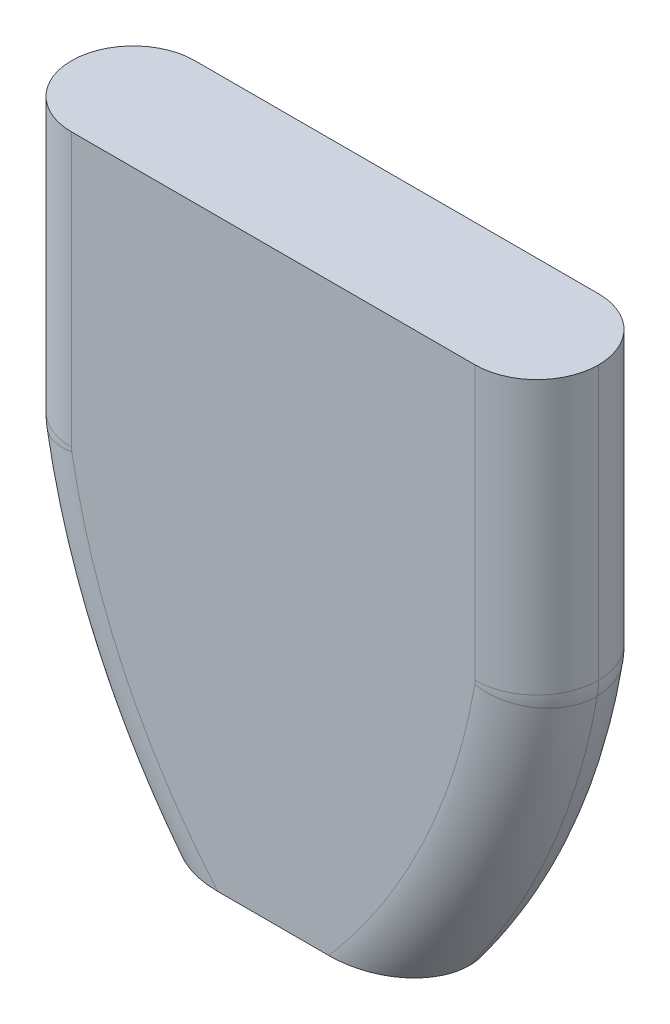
ISO-10303-21;
HEADER;
FILE_DESCRIPTION(('STEP AP214'),'2;1');
FILE_NAME('part.step','',(''),(''),'','','');
FILE_SCHEMA(('AUTOMOTIVE_DESIGN { 1 0 10303 214 1 1 1 1 }'));
ENDSEC;
DATA;
#1=APPLICATION_CONTEXT('core data for automotive mechanical design processes');
#2=APPLICATION_PROTOCOL_DEFINITION('international standard','automotive_design',2000,#1);
#3=PRODUCT_CONTEXT('',#1,'mechanical');
#4=PRODUCT('Part','Part','',(#3));
#5=PRODUCT_RELATED_PRODUCT_CATEGORY('part','',(#4));
#6=PRODUCT_DEFINITION_FORMATION('','',#4);
#7=PRODUCT_DEFINITION_CONTEXT('part definition',#1,'design');
#8=PRODUCT_DEFINITION('design','',#6,#7);
#9=PRODUCT_DEFINITION_SHAPE('','',#8);
#10=(LENGTH_UNIT() NAMED_UNIT(*) SI_UNIT(.MILLI.,.METRE.));
#11=(NAMED_UNIT(*) PLANE_ANGLE_UNIT() SI_UNIT($,.RADIAN.));
#12=(NAMED_UNIT(*) SI_UNIT($,.STERADIAN.) SOLID_ANGLE_UNIT());
#13=UNCERTAINTY_MEASURE_WITH_UNIT(LENGTH_MEASURE(1.E-05),#10,'distance_accuracy_value','');
#14=(GEOMETRIC_REPRESENTATION_CONTEXT(3) GLOBAL_UNCERTAINTY_ASSIGNED_CONTEXT((#13)) GLOBAL_UNIT_ASSIGNED_CONTEXT((#10,
#11,#12)) REPRESENTATION_CONTEXT('',''));
#15=CARTESIAN_POINT('',(0.,0.,0.));
#16=DIRECTION('',(0.,0.,1.));
#17=DIRECTION('',(1.,0.,0.));
#18=AXIS2_PLACEMENT_3D('',#15,#16,#17);
#19=CARTESIAN_POINT('',(-23.9835705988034,21.2,11.));
#20=DIRECTION('',(0.,1.,0.));
#21=DIRECTION('',(0.,0.,1.));
#22=AXIS2_PLACEMENT_3D('',#19,#20,#21);
#23=PLANE('',#22);
#24=DIRECTION('',(1.,0.,0.));
#25=VECTOR('',#24,1.);
#26=CARTESIAN_POINT('',(-23.9835705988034,21.2,-11.));
#27=LINE('',#26,#25);
#28=CARTESIAN_POINT('',(-9.89247671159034,21.2,-11.));
#29=VERTEX_POINT('',#28);
#30=CARTESIAN_POINT('',(9.89247671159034,21.2,-11.));
#31=VERTEX_POINT('',#30);
#32=EDGE_CURVE('E516',#29,#31,#27,.T.);
#33=ORIENTED_EDGE('',*,*,#32,.T.);
#34=CARTESIAN_POINT('',(9.89247671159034,21.2,-11.));
#35=CARTESIAN_POINT('',(10.3559519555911,21.2,-10.9999702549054));
#36=CARTESIAN_POINT('',(10.8195148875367,21.2,-10.9832334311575));
#37=CARTESIAN_POINT('',(11.7445224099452,21.2,-10.9153931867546));
#38=CARTESIAN_POINT('',(12.2059647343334,21.2,-10.8642590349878));
#39=CARTESIAN_POINT('',(13.1269797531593,21.2,-10.7261614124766));
#40=CARTESIAN_POINT('',(13.5865136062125,21.2,-10.6389366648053));
#41=CARTESIAN_POINT('',(14.4969021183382,21.2,-10.4275508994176));
#42=CARTESIAN_POINT('',(14.9477598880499,21.2,-10.303403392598));
#43=CARTESIAN_POINT('',(15.7691077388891,21.2,-10.0389466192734));
#44=CARTESIAN_POINT('',(16.1413342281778,21.2,-9.90402164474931));
#45=CARTESIAN_POINT('',(16.8745855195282,21.2,-9.60609086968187));
#46=CARTESIAN_POINT('',(17.2356064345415,21.2,-9.44307545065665));
#47=CARTESIAN_POINT('',(17.9423696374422,21.2,-9.08887556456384));
#48=CARTESIAN_POINT('',(18.2881508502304,21.2,-8.89776900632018));
#49=CARTESIAN_POINT('',(18.9619336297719,21.2,-8.48672590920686));
#50=CARTESIAN_POINT('',(19.2899464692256,21.2,-8.26680795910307));
#51=CARTESIAN_POINT('',(19.8627640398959,21.2,-7.84359781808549));
#52=CARTESIAN_POINT('',(20.1113390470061,21.2,-7.64539906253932));
#53=CARTESIAN_POINT('',(20.5922942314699,21.2,-7.2303817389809));
#54=CARTESIAN_POINT('',(20.8246817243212,21.2,-7.01357168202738));
#55=CARTESIAN_POINT('',(21.2711099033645,21.2,-6.56149793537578));
#56=CARTESIAN_POINT('',(21.4851387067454,21.2,-6.32622247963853));
#57=CARTESIAN_POINT('',(21.8921176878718,21.2,-5.83804754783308));
#58=CARTESIAN_POINT('',(22.0850679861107,21.2,-5.58514817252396));
#59=CARTESIAN_POINT('',(22.4489827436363,21.2,-5.06030531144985));
#60=CARTESIAN_POINT('',(22.6197164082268,21.2,-4.78820123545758));
#61=CARTESIAN_POINT('',(22.9342134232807,21.2,-4.22884629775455));
#62=CARTESIAN_POINT('',(23.0779817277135,21.2,-3.94159823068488));
#63=CARTESIAN_POINT('',(23.3357414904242,21.2,-3.35465211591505));
#64=CARTESIAN_POINT('',(23.4497898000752,21.2,-3.05497912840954));
#65=CARTESIAN_POINT('',(23.6461404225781,21.2,-2.4455844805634));
#66=CARTESIAN_POINT('',(23.72846219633,21.2,-2.13586910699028));
#67=CARTESIAN_POINT('',(23.8568066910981,21.2,-1.5231195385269));
#68=CARTESIAN_POINT('',(23.9042639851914,21.2,-1.22038871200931));
#69=CARTESIAN_POINT('',(23.9518024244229,21.2,-0.763971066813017));
#70=CARTESIAN_POINT('',(23.9637073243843,21.2,-0.611437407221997));
#71=CARTESIAN_POINT('',(23.9795931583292,21.2,-0.30594499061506));
#72=CARTESIAN_POINT('',(23.9835734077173,21.2,-0.152986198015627));
#73=CARTESIAN_POINT('',(23.9835705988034,21.2,0.));
#74=B_SPLINE_CURVE_WITH_KNOTS('',3,(#34,#35,#36,#37,#38,#39,#40,#41,#42,#43,#44,#45,#46,#47,#48,
#49,#50,#51,#52,#53,#54,#55,#56,#57,#58,#59,#60,#61,#62,#63,#64,#65,#66,#67,#68,#69,#70,#71,#72,
#73),.UNSPECIFIED.,.F.,.F.,(4,2,2,2,2,2,2,2,2,2,2,2,2,2,2,2,2,2,2,4),(0.,1.39025888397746,
2.78176149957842,4.1835191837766,5.58476456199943,6.77148037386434,7.95860334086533,
9.14249394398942,10.3256244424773,11.2785057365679,12.2309535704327,13.1840133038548,
14.1370675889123,15.0993434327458,16.0614423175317,17.021687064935,17.9813418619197,
18.8988778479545,19.3576908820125,19.8165435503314),.UNSPECIFIED.);
#75=CARTESIAN_POINT('',(23.9835705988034,21.2,0.));
#76=VERTEX_POINT('',#75);
#77=EDGE_CURVE('E579',#31,#76,#74,.T.);
#78=ORIENTED_EDGE('',*,*,#77,.T.);
#79=CARTESIAN_POINT('',(23.9835705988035,21.2,0.));
#80=CARTESIAN_POINT('',(23.9835720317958,21.2,0.132510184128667));
#81=CARTESIAN_POINT('',(23.980586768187,21.2,0.265001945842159));
#82=CARTESIAN_POINT('',(23.9686652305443,21.2,0.529712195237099));
#83=CARTESIAN_POINT('',(23.9597291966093,21.2,0.661930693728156));
#84=CARTESIAN_POINT('',(23.9240442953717,21.2,1.05765866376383));
#85=CARTESIAN_POINT('',(23.8884185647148,21.2,1.32042102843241));
#86=CARTESIAN_POINT('',(23.794305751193,21.2,1.84028020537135));
#87=CARTESIAN_POINT('',(23.7359449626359,21.2,2.09740016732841));
#88=CARTESIAN_POINT('',(23.597220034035,21.2,2.60564827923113));
#89=CARTESIAN_POINT('',(23.5168544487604,21.2,2.85677603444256));
#90=CARTESIAN_POINT('',(23.3354068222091,21.2,3.35092861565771));
#91=CARTESIAN_POINT('',(23.2343599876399,21.2,3.59396640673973));
#92=CARTESIAN_POINT('',(23.0127422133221,21.2,4.07106491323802));
#93=CARTESIAN_POINT('',(22.8921636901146,21.2,4.30512209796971));
#94=CARTESIAN_POINT('',(22.6328656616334,21.2,4.7631498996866));
#95=CARTESIAN_POINT('',(22.4941338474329,21.2,4.98711353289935));
#96=CARTESIAN_POINT('',(22.2000490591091,21.2,5.42394254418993));
#97=CARTESIAN_POINT('',(22.0446898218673,21.2,5.63680369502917));
#98=CARTESIAN_POINT('',(21.7084713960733,21.2,6.06390363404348));
#99=CARTESIAN_POINT('',(21.5266163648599,21.2,6.27735780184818));
#100=CARTESIAN_POINT('',(21.1475738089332,21.2,6.69030188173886));
#101=CARTESIAN_POINT('',(20.9503802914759,21.2,6.8897862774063));
#102=CARTESIAN_POINT('',(20.5424700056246,21.2,7.27429784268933));
#103=CARTESIAN_POINT('',(20.3317561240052,21.2,7.45932807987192));
#104=CARTESIAN_POINT('',(19.8983503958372,21.2,7.8148097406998));
#105=CARTESIAN_POINT('',(19.6756562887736,21.2,7.98525839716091));
#106=CARTESIAN_POINT('',(19.1171409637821,21.2,8.38495908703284));
#107=CARTESIAN_POINT('',(18.7755172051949,21.2,8.6061469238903));
#108=CARTESIAN_POINT('',(18.0742757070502,21.2,9.01794115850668));
#109=CARTESIAN_POINT('',(17.7146516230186,21.2,9.20853667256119));
#110=CARTESIAN_POINT('',(16.9799109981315,21.2,9.56016167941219));
#111=CARTESIAN_POINT('',(16.6047501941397,21.2,9.72109839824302));
#112=CARTESIAN_POINT('',(15.8430682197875,21.2,10.0133918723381));
#113=CARTESIAN_POINT('',(15.4565453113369,21.2,10.1447440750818));
#114=CARTESIAN_POINT('',(14.6454020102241,21.2,10.3874432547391));
#115=CARTESIAN_POINT('',(14.2201074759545,21.2,10.4965331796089));
#116=CARTESIAN_POINT('',(13.3624462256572,21.2,10.682343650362));
#117=CARTESIAN_POINT('',(12.930077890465,21.2,10.7590566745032));
#118=CARTESIAN_POINT('',(12.0643669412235,21.2,10.8805153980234));
#119=CARTESIAN_POINT('',(11.6310585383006,21.2,10.9255069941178));
#120=CARTESIAN_POINT('',(10.7626363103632,21.2,10.9852275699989));
#121=CARTESIAN_POINT('',(10.327523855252,21.2,10.9999763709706));
#122=CARTESIAN_POINT('',(9.89247671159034,21.2,11.));
#123=B_SPLINE_CURVE_WITH_KNOTS('',3,(#79,#80,#81,#82,#83,#84,#85,#86,#87,#88,#89,#90,#91,#92,
#93,#94,#95,#96,#97,#98,#99,#100,#101,#102,#103,#104,#105,#106,#107,#108,#109,#110,#111,#112,
#113,#114,#115,#116,#117,#118,#119,#120,#121,#122),.UNSPECIFIED.,.F.,.F.,(4,2,2,2,2,2,2,2,2,2,2,
2,2,2,2,2,2,2,2,2,2,4),(0.,0.39746040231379,0.794904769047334,1.58925422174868,2.37925254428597,
3.16930276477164,3.95801906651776,4.74704233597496,5.53660340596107,6.32646293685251,
7.16690125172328,8.00766959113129,8.84825900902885,9.68900759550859,10.908180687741,
12.1277865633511,13.3511449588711,14.5746914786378,15.8905517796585,17.2067176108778,
18.5125652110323,19.8175566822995),.UNSPECIFIED.);
#124=CARTESIAN_POINT('',(9.89247671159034,21.2,11.));
#125=VERTEX_POINT('',#124);
#126=EDGE_CURVE('E483',#76,#125,#123,.T.);
#127=ORIENTED_EDGE('',*,*,#126,.T.);
#128=DIRECTION('',(1.,0.,0.));
#129=VECTOR('',#128,1.);
#130=CARTESIAN_POINT('',(-23.9835705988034,21.2,11.));
#131=LINE('',#130,#129);
#132=CARTESIAN_POINT('',(-9.89247671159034,21.2,11.));
#133=VERTEX_POINT('',#132);
#134=EDGE_CURVE('E522',#133,#125,#131,.T.);
#135=ORIENTED_EDGE('',*,*,#134,.F.);
#136=CARTESIAN_POINT('',(-9.89247671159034,21.2,11.));
#137=CARTESIAN_POINT('',(-10.3559519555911,21.2,10.9999702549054));
#138=CARTESIAN_POINT('',(-10.8195148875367,21.2,10.9832334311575));
#139=CARTESIAN_POINT('',(-11.7445224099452,21.2,10.9153931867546));
#140=CARTESIAN_POINT('',(-12.2059647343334,21.2,10.8642590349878));
#141=CARTESIAN_POINT('',(-13.1269797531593,21.2,10.7261614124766));
#142=CARTESIAN_POINT('',(-13.5865136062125,21.2,10.6389366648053));
#143=CARTESIAN_POINT('',(-14.4969021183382,21.2,10.4275508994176));
#144=CARTESIAN_POINT('',(-14.9477598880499,21.2,10.303403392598));
#145=CARTESIAN_POINT('',(-15.7691077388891,21.2,10.0389466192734));
#146=CARTESIAN_POINT('',(-16.1413342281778,21.2,9.90402164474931));
#147=CARTESIAN_POINT('',(-16.8745855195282,21.2,9.60609086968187));
#148=CARTESIAN_POINT('',(-17.2356064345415,21.2,9.44307545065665));
#149=CARTESIAN_POINT('',(-17.9423696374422,21.2,9.08887556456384));
#150=CARTESIAN_POINT('',(-18.2881508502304,21.2,8.89776900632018));
#151=CARTESIAN_POINT('',(-18.9619336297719,21.2,8.48672590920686));
#152=CARTESIAN_POINT('',(-19.2899464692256,21.2,8.26680795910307));
#153=CARTESIAN_POINT('',(-19.8627640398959,21.2,7.84359781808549));
#154=CARTESIAN_POINT('',(-20.1113390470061,21.2,7.64539906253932));
#155=CARTESIAN_POINT('',(-20.5922942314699,21.2,7.2303817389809));
#156=CARTESIAN_POINT('',(-20.8246817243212,21.2,7.01357168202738));
#157=CARTESIAN_POINT('',(-21.2711099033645,21.2,6.56149793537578));
#158=CARTESIAN_POINT('',(-21.4851387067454,21.2,6.32622247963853));
#159=CARTESIAN_POINT('',(-21.8921176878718,21.2,5.83804754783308));
#160=CARTESIAN_POINT('',(-22.0850679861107,21.2,5.58514817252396));
#161=CARTESIAN_POINT('',(-22.4489827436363,21.2,5.06030531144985));
#162=CARTESIAN_POINT('',(-22.6197164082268,21.2,4.78820123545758));
#163=CARTESIAN_POINT('',(-22.9342134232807,21.2,4.22884629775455));
#164=CARTESIAN_POINT('',(-23.0779817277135,21.2,3.94159823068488));
#165=CARTESIAN_POINT('',(-23.3357414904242,21.2,3.35465211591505));
#166=CARTESIAN_POINT('',(-23.4497898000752,21.2,3.05497912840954));
#167=CARTESIAN_POINT('',(-23.6461404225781,21.2,2.4455844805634));
#168=CARTESIAN_POINT('',(-23.72846219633,21.2,2.13586910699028));
#169=CARTESIAN_POINT('',(-23.8568066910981,21.2,1.5231195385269));
#170=CARTESIAN_POINT('',(-23.9042639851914,21.2,1.22038871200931));
#171=CARTESIAN_POINT('',(-23.9518024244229,21.2,0.763971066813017));
#172=CARTESIAN_POINT('',(-23.9637073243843,21.2,0.611437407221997));
#173=CARTESIAN_POINT('',(-23.9795931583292,21.2,0.30594499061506));
#174=CARTESIAN_POINT('',(-23.9835734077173,21.2,0.152986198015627));
#175=CARTESIAN_POINT('',(-23.9835705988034,21.2,0.));
#176=B_SPLINE_CURVE_WITH_KNOTS('',3,(#136,#137,#138,#139,#140,#141,#142,#143,#144,#145,#146,
#147,#148,#149,#150,#151,#152,#153,#154,#155,#156,#157,#158,#159,#160,#161,#162,#163,#164,#165,
#166,#167,#168,#169,#170,#171,#172,#173,#174,#175),.UNSPECIFIED.,.F.,.F.,(4,2,2,2,2,2,2,2,2,2,2,
2,2,2,2,2,2,2,2,4),(0.,1.39025888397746,2.78176149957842,4.1835191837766,5.58476456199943,
6.77148037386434,7.95860334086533,9.14249394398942,10.3256244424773,11.2785057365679,
12.2309535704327,13.1840133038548,14.1370675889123,15.0993434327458,16.0614423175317,
17.021687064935,17.9813418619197,18.8988778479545,19.3576908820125,19.8165435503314),.UNSPECIFIED.);
#177=CARTESIAN_POINT('',(-23.9835705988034,21.2,0.));
#178=VERTEX_POINT('',#177);
#179=EDGE_CURVE('E527',#133,#178,#176,.T.);
#180=ORIENTED_EDGE('',*,*,#179,.T.);
#181=CARTESIAN_POINT('',(-23.9835705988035,21.2,0.));
#182=CARTESIAN_POINT('',(-23.9835720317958,21.2,-0.132510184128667));
#183=CARTESIAN_POINT('',(-23.980586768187,21.2,-0.265001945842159));
#184=CARTESIAN_POINT('',(-23.9686652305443,21.2,-0.529712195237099));
#185=CARTESIAN_POINT('',(-23.9597291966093,21.2,-0.661930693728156));
#186=CARTESIAN_POINT('',(-23.9240442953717,21.2,-1.05765866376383));
#187=CARTESIAN_POINT('',(-23.8884185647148,21.2,-1.32042102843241));
#188=CARTESIAN_POINT('',(-23.794305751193,21.2,-1.84028020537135));
#189=CARTESIAN_POINT('',(-23.7359449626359,21.2,-2.09740016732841));
#190=CARTESIAN_POINT('',(-23.597220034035,21.2,-2.60564827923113));
#191=CARTESIAN_POINT('',(-23.5168544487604,21.2,-2.85677603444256));
#192=CARTESIAN_POINT('',(-23.3354068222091,21.2,-3.35092861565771));
#193=CARTESIAN_POINT('',(-23.2343599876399,21.2,-3.59396640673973));
#194=CARTESIAN_POINT('',(-23.0127422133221,21.2,-4.07106491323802));
#195=CARTESIAN_POINT('',(-22.8921636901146,21.2,-4.30512209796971));
#196=CARTESIAN_POINT('',(-22.6328656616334,21.2,-4.7631498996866));
#197=CARTESIAN_POINT('',(-22.4941338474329,21.2,-4.98711353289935));
#198=CARTESIAN_POINT('',(-22.2000490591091,21.2,-5.42394254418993));
#199=CARTESIAN_POINT('',(-22.0446898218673,21.2,-5.63680369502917));
#200=CARTESIAN_POINT('',(-21.7084713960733,21.2,-6.06390363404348));
#201=CARTESIAN_POINT('',(-21.5266163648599,21.2,-6.27735780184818));
#202=CARTESIAN_POINT('',(-21.1475738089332,21.2,-6.69030188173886));
#203=CARTESIAN_POINT('',(-20.9503802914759,21.2,-6.8897862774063));
#204=CARTESIAN_POINT('',(-20.5424700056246,21.2,-7.27429784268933));
#205=CARTESIAN_POINT('',(-20.3317561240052,21.2,-7.45932807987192));
#206=CARTESIAN_POINT('',(-19.8983503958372,21.2,-7.8148097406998));
#207=CARTESIAN_POINT('',(-19.6756562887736,21.2,-7.98525839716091));
#208=CARTESIAN_POINT('',(-19.1171409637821,21.2,-8.38495908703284));
#209=CARTESIAN_POINT('',(-18.7755172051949,21.2,-8.6061469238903));
#210=CARTESIAN_POINT('',(-18.0742757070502,21.2,-9.01794115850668));
#211=CARTESIAN_POINT('',(-17.7146516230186,21.2,-9.20853667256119));
#212=CARTESIAN_POINT('',(-16.9799109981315,21.2,-9.56016167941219));
#213=CARTESIAN_POINT('',(-16.6047501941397,21.2,-9.72109839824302));
#214=CARTESIAN_POINT('',(-15.8430682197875,21.2,-10.0133918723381));
#215=CARTESIAN_POINT('',(-15.4565453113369,21.2,-10.1447440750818));
#216=CARTESIAN_POINT('',(-14.6454020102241,21.2,-10.3874432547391));
#217=CARTESIAN_POINT('',(-14.2201074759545,21.2,-10.4965331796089));
#218=CARTESIAN_POINT('',(-13.3624462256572,21.2,-10.682343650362));
#219=CARTESIAN_POINT('',(-12.930077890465,21.2,-10.7590566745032));
#220=CARTESIAN_POINT('',(-12.0643669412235,21.2,-10.8805153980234));
#221=CARTESIAN_POINT('',(-11.6310585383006,21.2,-10.9255069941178));
#222=CARTESIAN_POINT('',(-10.7626363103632,21.2,-10.9852275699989));
#223=CARTESIAN_POINT('',(-10.327523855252,21.2,-10.9999763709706));
#224=CARTESIAN_POINT('',(-9.89247671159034,21.2,-11.));
#225=B_SPLINE_CURVE_WITH_KNOTS('',3,(#181,#182,#183,#184,#185,#186,#187,#188,#189,#190,#191,
#192,#193,#194,#195,#196,#197,#198,#199,#200,#201,#202,#203,#204,#205,#206,#207,#208,#209,#210,
#211,#212,#213,#214,#215,#216,#217,#218,#219,#220,#221,#222,#223,#224),.UNSPECIFIED.,.F.,.F.,(4,
2,2,2,2,2,2,2,2,2,2,2,2,2,2,2,2,2,2,2,2,4),(0.,0.39746040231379,0.794904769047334,
1.58925422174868,2.37925254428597,3.16930276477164,3.95801906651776,4.74704233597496,
5.53660340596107,6.32646293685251,7.16690125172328,8.00766959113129,8.84825900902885,
9.68900759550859,10.908180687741,12.1277865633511,13.3511449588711,14.5746914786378,
15.8905517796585,17.2067176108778,18.5125652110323,19.8175566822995),.UNSPECIFIED.);
#226=EDGE_CURVE('E533',#178,#29,#225,.T.);
#227=ORIENTED_EDGE('',*,*,#226,.T.);
#228=EDGE_LOOP('',(#33,#78,#127,#135,#180,#227));
#229=FACE_BOUND('',#228,.T.);
#230=ADVANCED_FACE('F368',(#229),#23,.F.);
#231=CARTESIAN_POINT('',(-47.,125.5,11.));
#232=DIRECTION('',(0.,1.,0.));
#233=DIRECTION('',(0.,0.,1.));
#234=AXIS2_PLACEMENT_3D('',#231,#232,#233);
#235=PLANE('',#234);
#236=CARTESIAN_POINT('',(36.,125.5,0.));
#237=DIRECTION('',(0.,1.,0.));
#238=DIRECTION('',(0.,0.,1.));
#239=AXIS2_PLACEMENT_3D('',#236,#237,#238);
#240=CIRCLE('',#239,11.);
#241=CARTESIAN_POINT('',(36.,125.5,11.));
#242=VERTEX_POINT('',#241);
#243=CARTESIAN_POINT('',(47.,125.5,0.));
#244=VERTEX_POINT('',#243);
#245=EDGE_CURVE('E376',#242,#244,#240,.T.);
#246=ORIENTED_EDGE('',*,*,#245,.T.);
#247=CARTESIAN_POINT('',(36.,125.5,0.));
#248=DIRECTION('',(0.,1.,0.));
#249=DIRECTION('',(0.,0.,1.));
#250=AXIS2_PLACEMENT_3D('',#247,#248,#249);
#251=CIRCLE('',#250,11.);
#252=CARTESIAN_POINT('',(36.,125.5,-11.));
#253=VERTEX_POINT('',#252);
#254=EDGE_CURVE('E12',#244,#253,#251,.T.);
#255=ORIENTED_EDGE('',*,*,#254,.T.);
#256=DIRECTION('',(1.,0.,0.));
#257=VECTOR('',#256,1.);
#258=CARTESIAN_POINT('',(-47.,125.5,-11.));
#259=LINE('',#258,#257);
#260=CARTESIAN_POINT('',(-36.,125.5,-11.));
#261=VERTEX_POINT('',#260);
#262=EDGE_CURVE('E519',#261,#253,#259,.T.);
#263=ORIENTED_EDGE('',*,*,#262,.F.);
#264=CARTESIAN_POINT('',(-36.,125.5,0.));
#265=DIRECTION('',(0.,1.,0.));
#266=DIRECTION('',(0.,0.,1.));
#267=AXIS2_PLACEMENT_3D('',#264,#265,#266);
#268=CIRCLE('',#267,11.);
#269=CARTESIAN_POINT('',(-47.,125.5,0.));
#270=VERTEX_POINT('',#269);
#271=EDGE_CURVE('E383',#261,#270,#268,.T.);
#272=ORIENTED_EDGE('',*,*,#271,.T.);
#273=CARTESIAN_POINT('',(-36.,125.5,0.));
#274=DIRECTION('',(0.,1.,0.));
#275=DIRECTION('',(0.,0.,1.));
#276=AXIS2_PLACEMENT_3D('',#273,#274,#275);
#277=CIRCLE('',#276,11.);
#278=CARTESIAN_POINT('',(-36.,125.5,11.));
#279=VERTEX_POINT('',#278);
#280=EDGE_CURVE('E604',#270,#279,#277,.T.);
#281=ORIENTED_EDGE('',*,*,#280,.T.);
#282=DIRECTION('',(1.,0.,0.));
#283=VECTOR('',#282,1.);
#284=CARTESIAN_POINT('',(-47.,125.5,11.));
#285=LINE('',#284,#283);
#286=EDGE_CURVE('E525',#279,#242,#285,.T.);
#287=ORIENTED_EDGE('',*,*,#286,.T.);
#288=EDGE_LOOP('',(#246,#255,#263,#272,#281,#287));
#289=FACE_BOUND('',#288,.T.);
#290=ADVANCED_FACE('F569',(#289),#235,.T.);
#291=CARTESIAN_POINT('',(-76.3478497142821,95.7560601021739,11.));
#292=DIRECTION('',(0.,0.,-1.));
#293=DIRECTION('',(-1.,0.,0.));
#294=AXIS2_PLACEMENT_3D('',#291,#292,#293);
#295=PLANE('',#294);
#296=ORIENTED_EDGE('',*,*,#134,.T.);
#297=CARTESIAN_POINT('',(-76.3478497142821,95.7560601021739,11.));
#298=DIRECTION('',(0.,0.,-1.));
#299=DIRECTION('',(-1.,0.,0.));
#300=AXIS2_PLACEMENT_3D('',#297,#298,#299);
#301=CIRCLE('',#300,114.);
#302=CARTESIAN_POINT('',(35.9399218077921,76.0721487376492,11.));
#303=VERTEX_POINT('',#302);
#304=EDGE_CURVE('E602',#125,#303,#301,.F.);
#305=ORIENTED_EDGE('',*,*,#304,.T.);
#306=CARTESIAN_POINT('',(32.,76.7628122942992,11.));
#307=DIRECTION('',(0.,0.,-1.));
#308=DIRECTION('',(-1.,0.,0.));
#309=AXIS2_PLACEMENT_3D('',#306,#307,#308);
#310=CIRCLE('',#309,3.99999999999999);
#311=CARTESIAN_POINT('',(36.,76.7628122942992,11.));
#312=VERTEX_POINT('',#311);
#313=EDGE_CURVE('E463',#303,#312,#310,.F.);
#314=ORIENTED_EDGE('',*,*,#313,.T.);
#315=DIRECTION('',(0.,-1.,0.));
#316=VECTOR('',#315,1.);
#317=CARTESIAN_POINT('',(36.,125.5,11.));
#318=LINE('',#317,#316);
#319=EDGE_CURVE('E599',#312,#242,#318,.F.);
#320=ORIENTED_EDGE('',*,*,#319,.T.);
#321=ORIENTED_EDGE('',*,*,#286,.F.);
#322=DIRECTION('',(0.,-1.,0.));
#323=VECTOR('',#322,1.);
#324=CARTESIAN_POINT('',(-36.,95.7560601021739,11.));
#325=LINE('',#324,#323);
#326=CARTESIAN_POINT('',(-36.,76.7628122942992,11.));
#327=VERTEX_POINT('',#326);
#328=EDGE_CURVE('E587',#279,#327,#325,.T.);
#329=ORIENTED_EDGE('',*,*,#328,.T.);
#330=CARTESIAN_POINT('',(-32.,76.7628122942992,11.));
#331=DIRECTION('',(0.,0.,-1.));
#332=DIRECTION('',(-1.,0.,0.));
#333=AXIS2_PLACEMENT_3D('',#330,#331,#332);
#334=CIRCLE('',#333,3.99999999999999);
#335=CARTESIAN_POINT('',(-35.9399218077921,76.0721487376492,11.));
#336=VERTEX_POINT('',#335);
#337=EDGE_CURVE('E590',#327,#336,#334,.F.);
#338=ORIENTED_EDGE('',*,*,#337,.T.);
#339=CARTESIAN_POINT('',(76.3478497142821,95.7560601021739,11.));
#340=DIRECTION('',(0.,0.,-1.));
#341=DIRECTION('',(-1.,0.,0.));
#342=AXIS2_PLACEMENT_3D('',#339,#340,#341);
#343=CIRCLE('',#342,114.);
#344=EDGE_CURVE('E597',#336,#133,#343,.F.);
#345=ORIENTED_EDGE('',*,*,#344,.T.);
#346=EDGE_LOOP('',(#296,#305,#314,#320,#321,#329,#338,#345));
#347=FACE_BOUND('',#346,.T.);
#348=ADVANCED_FACE('F566',(#347),#295,.F.);
#349=CARTESIAN_POINT('',(-76.3478497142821,95.7560601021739,-11.));
#350=DIRECTION('',(0.,0.,-1.));
#351=DIRECTION('',(-1.,0.,0.));
#352=AXIS2_PLACEMENT_3D('',#349,#350,#351);
#353=PLANE('',#352);
#354=ORIENTED_EDGE('',*,*,#32,.F.);
#355=CARTESIAN_POINT('',(76.3478497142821,95.7560601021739,-11.));
#356=DIRECTION('',(0.,0.,-1.));
#357=DIRECTION('',(-1.,0.,0.));
#358=AXIS2_PLACEMENT_3D('',#355,#356,#357);
#359=CIRCLE('',#358,114.);
#360=CARTESIAN_POINT('',(-35.9399218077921,76.0721487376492,-11.));
#361=VERTEX_POINT('',#360);
#362=EDGE_CURVE('E583',#29,#361,#359,.T.);
#363=ORIENTED_EDGE('',*,*,#362,.T.);
#364=CARTESIAN_POINT('',(-32.,76.7628122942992,-11.));
#365=DIRECTION('',(0.,0.,-1.));
#366=DIRECTION('',(-1.,0.,0.));
#367=AXIS2_PLACEMENT_3D('',#364,#365,#366);
#368=CIRCLE('',#367,3.99999999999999);
#369=CARTESIAN_POINT('',(-36.,76.7628122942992,-11.));
#370=VERTEX_POINT('',#369);
#371=EDGE_CURVE('E588',#361,#370,#368,.T.);
#372=ORIENTED_EDGE('',*,*,#371,.T.);
#373=DIRECTION('',(0.,-1.,0.));
#374=VECTOR('',#373,1.);
#375=CARTESIAN_POINT('',(-36.,125.5,-11.));
#376=LINE('',#375,#374);
#377=EDGE_CURVE('E592',#370,#261,#376,.F.);
#378=ORIENTED_EDGE('',*,*,#377,.T.);
#379=ORIENTED_EDGE('',*,*,#262,.T.);
#380=DIRECTION('',(0.,-1.,0.));
#381=VECTOR('',#380,1.);
#382=CARTESIAN_POINT('',(36.,95.7560601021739,-11.));
#383=LINE('',#382,#381);
#384=CARTESIAN_POINT('',(36.,76.7628122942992,-11.));
#385=VERTEX_POINT('',#384);
#386=EDGE_CURVE('E622',#253,#385,#383,.T.);
#387=ORIENTED_EDGE('',*,*,#386,.T.);
#388=CARTESIAN_POINT('',(32.,76.7628122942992,-11.));
#389=DIRECTION('',(0.,0.,-1.));
#390=DIRECTION('',(-1.,0.,0.));
#391=AXIS2_PLACEMENT_3D('',#388,#389,#390);
#392=CIRCLE('',#391,3.99999999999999);
#393=CARTESIAN_POINT('',(35.9399218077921,76.0721487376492,-11.));
#394=VERTEX_POINT('',#393);
#395=EDGE_CURVE('E618',#385,#394,#392,.T.);
#396=ORIENTED_EDGE('',*,*,#395,.T.);
#397=CARTESIAN_POINT('',(-76.3478497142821,95.7560601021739,-11.));
#398=DIRECTION('',(0.,0.,-1.));
#399=DIRECTION('',(-1.,0.,0.));
#400=AXIS2_PLACEMENT_3D('',#397,#398,#399);
#401=CIRCLE('',#400,114.);
#402=EDGE_CURVE('E488',#394,#31,#401,.T.);
#403=ORIENTED_EDGE('',*,*,#402,.T.);
#404=EDGE_LOOP('',(#354,#363,#372,#378,#379,#387,#396,#403));
#405=FACE_BOUND('',#404,.T.);
#406=ADVANCED_FACE('F562',(#405),#353,.T.);
#407=CARTESIAN_POINT('',(-36.,95.7560601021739,0.));
#408=DIRECTION('',(0.,-1.,0.));
#409=DIRECTION('',(1.,0.,0.));
#410=AXIS2_PLACEMENT_3D('',#407,#408,#409);
#411=CYLINDRICAL_SURFACE('',#410,11.);
#412=ORIENTED_EDGE('',*,*,#328,.F.);
#413=ORIENTED_EDGE('',*,*,#280,.F.);
#414=DIRECTION('',(0.,-1.,0.));
#415=VECTOR('',#414,1.);
#416=CARTESIAN_POINT('',(-47.,125.5,0.));
#417=LINE('',#416,#415);
#418=CARTESIAN_POINT('',(-47.,76.7628122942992,0.));
#419=VERTEX_POINT('',#418);
#420=EDGE_CURVE('E513',#419,#270,#417,.F.);
#421=ORIENTED_EDGE('',*,*,#420,.F.);
#422=CARTESIAN_POINT('',(-36.,76.7628122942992,0.));
#423=DIRECTION('',(0.,-1.,0.));
#424=DIRECTION('',(0.,0.,-1.));
#425=AXIS2_PLACEMENT_3D('',#422,#423,#424);
#426=CIRCLE('',#425,11.);
#427=EDGE_CURVE('E510',#327,#419,#426,.T.);
#428=ORIENTED_EDGE('',*,*,#427,.F.);
#429=EDGE_LOOP('',(#412,#413,#421,#428));
#430=FACE_BOUND('',#429,.T.);
#431=ADVANCED_FACE('F558',(#430),#411,.T.);
#432=CARTESIAN_POINT('',(-36.,125.5,0.));
#433=DIRECTION('',(0.,1.,0.));
#434=DIRECTION('',(-1.,0.,0.));
#435=AXIS2_PLACEMENT_3D('',#432,#433,#434);
#436=CYLINDRICAL_SURFACE('',#435,11.);
#437=ORIENTED_EDGE('',*,*,#271,.F.);
#438=ORIENTED_EDGE('',*,*,#377,.F.);
#439=CARTESIAN_POINT('',(-36.,76.7628122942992,0.));
#440=DIRECTION('',(0.,-1.,0.));
#441=DIRECTION('',(0.,0.,-1.));
#442=AXIS2_PLACEMENT_3D('',#439,#440,#441);
#443=CIRCLE('',#442,11.);
#444=EDGE_CURVE('E507',#419,#370,#443,.T.);
#445=ORIENTED_EDGE('',*,*,#444,.F.);
#446=ORIENTED_EDGE('',*,*,#420,.T.);
#447=EDGE_LOOP('',(#437,#438,#445,#446));
#448=FACE_BOUND('',#447,.T.);
#449=ADVANCED_FACE('F554',(#448),#436,.T.);
#450=CARTESIAN_POINT('',(-32.,76.7628122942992,0.));
#451=DIRECTION('',(0.,0.,-1.));
#452=DIRECTION('',(-1.,0.,0.));
#453=AXIS2_PLACEMENT_3D('',#450,#451,#452);
#454=DEGENERATE_TOROIDAL_SURFACE('',#453,3.99999999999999,11.,.T.);
#455=ORIENTED_EDGE('',*,*,#337,.F.);
#456=ORIENTED_EDGE('',*,*,#427,.T.);
#457=CARTESIAN_POINT('',(-32.,76.7628122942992,0.));
#458=DIRECTION('',(0.,0.,-1.));
#459=DIRECTION('',(-1.,0.,0.));
#460=AXIS2_PLACEMENT_3D('',#457,#458,#459);
#461=CIRCLE('',#460,15.);
#462=CARTESIAN_POINT('',(-46.7747067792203,74.1728239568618,0.));
#463=VERTEX_POINT('',#462);
#464=EDGE_CURVE('E504',#463,#419,#461,.T.);
#465=ORIENTED_EDGE('',*,*,#464,.F.);
#466=CARTESIAN_POINT('',(-35.9399218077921,76.0721487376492,0.));
#467=DIRECTION('',(0.172665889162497,-0.984980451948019,0.));
#468=DIRECTION('',(0.984980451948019,0.172665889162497,0.));
#469=AXIS2_PLACEMENT_3D('',#466,#467,#468);
#470=CIRCLE('',#469,11.);
#471=EDGE_CURVE('E501',#336,#463,#470,.T.);
#472=ORIENTED_EDGE('',*,*,#471,.F.);
#473=EDGE_LOOP('',(#455,#456,#465,#472));
#474=FACE_BOUND('',#473,.T.);
#475=ADVANCED_FACE('F550',(#474),#454,.T.);
#476=CARTESIAN_POINT('',(-32.,76.7628122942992,0.));
#477=DIRECTION('',(0.,0.,-1.));
#478=DIRECTION('',(-1.,0.,0.));
#479=AXIS2_PLACEMENT_3D('',#476,#477,#478);
#480=DEGENERATE_TOROIDAL_SURFACE('',#479,3.99999999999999,11.,.T.);
#481=ORIENTED_EDGE('',*,*,#444,.T.);
#482=ORIENTED_EDGE('',*,*,#371,.F.);
#483=CARTESIAN_POINT('',(-35.9399218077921,76.0721487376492,0.));
#484=DIRECTION('',(0.172665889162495,-0.98498045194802,0.));
#485=DIRECTION('',(0.98498045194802,0.172665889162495,0.));
#486=AXIS2_PLACEMENT_3D('',#483,#484,#485);
#487=CIRCLE('',#486,11.);
#488=EDGE_CURVE('E499',#463,#361,#487,.T.);
#489=ORIENTED_EDGE('',*,*,#488,.F.);
#490=ORIENTED_EDGE('',*,*,#464,.T.);
#491=EDGE_LOOP('',(#481,#482,#489,#490));
#492=FACE_BOUND('',#491,.T.);
#493=ADVANCED_FACE('F544',(#492),#480,.T.);
#494=CARTESIAN_POINT('',(76.3478497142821,95.7560601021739,0.));
#495=DIRECTION('',(0.,0.,-1.));
#496=DIRECTION('',(-1.,0.,0.));
#497=AXIS2_PLACEMENT_3D('',#494,#495,#496);
#498=TOROIDAL_SURFACE('',#497,114.,11.);
#499=ORIENTED_EDGE('',*,*,#344,.F.);
#500=ORIENTED_EDGE('',*,*,#471,.T.);
#501=CARTESIAN_POINT('',(76.3478497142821,95.7560601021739,0.));
#502=DIRECTION('',(0.,0.,-1.));
#503=DIRECTION('',(-1.,0.,0.));
#504=AXIS2_PLACEMENT_3D('',#501,#502,#503);
#505=CIRCLE('',#504,125.);
#506=EDGE_CURVE('E496',#178,#463,#505,.T.);
#507=ORIENTED_EDGE('',*,*,#506,.F.);
#508=ORIENTED_EDGE('',*,*,#179,.F.);
#509=EDGE_LOOP('',(#499,#500,#507,#508));
#510=FACE_BOUND('',#509,.T.);
#511=ADVANCED_FACE('F539',(#510),#498,.T.);
#512=CARTESIAN_POINT('',(76.3478497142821,95.7560601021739,0.));
#513=DIRECTION('',(0.,0.,-1.));
#514=DIRECTION('',(-1.,0.,0.));
#515=AXIS2_PLACEMENT_3D('',#512,#513,#514);
#516=TOROIDAL_SURFACE('',#515,114.,11.);
#517=ORIENTED_EDGE('',*,*,#488,.T.);
#518=ORIENTED_EDGE('',*,*,#362,.F.);
#519=ORIENTED_EDGE('',*,*,#226,.F.);
#520=ORIENTED_EDGE('',*,*,#506,.T.);
#521=EDGE_LOOP('',(#517,#518,#519,#520));
#522=FACE_BOUND('',#521,.T.);
#523=ADVANCED_FACE('F543',(#522),#516,.T.);
#524=CARTESIAN_POINT('',(36.,125.5,0.));
#525=DIRECTION('',(0.,1.,0.));
#526=DIRECTION('',(0.,0.,1.));
#527=AXIS2_PLACEMENT_3D('',#524,#525,#526);
#528=CYLINDRICAL_SURFACE('',#527,11.);
#529=ORIENTED_EDGE('',*,*,#245,.F.);
#530=ORIENTED_EDGE('',*,*,#319,.F.);
#531=CARTESIAN_POINT('',(36.,76.7628122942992,0.));
#532=DIRECTION('',(0.,-1.,0.));
#533=DIRECTION('',(0.,0.,-1.));
#534=AXIS2_PLACEMENT_3D('',#531,#532,#533);
#535=CIRCLE('',#534,11.);
#536=CARTESIAN_POINT('',(47.,76.7628122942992,0.));
#537=VERTEX_POINT('',#536);
#538=EDGE_CURVE('E494',#537,#312,#535,.T.);
#539=ORIENTED_EDGE('',*,*,#538,.F.);
#540=DIRECTION('',(0.,-1.,0.));
#541=VECTOR('',#540,1.);
#542=CARTESIAN_POINT('',(47.,76.7628122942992,0.));
#543=LINE('',#542,#541);
#544=EDGE_CURVE('E467',#244,#537,#543,.T.);
#545=ORIENTED_EDGE('',*,*,#544,.F.);
#546=EDGE_LOOP('',(#529,#530,#539,#545));
#547=FACE_BOUND('',#546,.T.);
#548=ADVANCED_FACE('F644',(#547),#528,.T.);
#549=CARTESIAN_POINT('',(32.,76.7628122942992,0.));
#550=DIRECTION('',(0.,0.,-1.));
#551=DIRECTION('',(-1.,0.,0.));
#552=AXIS2_PLACEMENT_3D('',#549,#550,#551);
#553=DEGENERATE_TOROIDAL_SURFACE('',#552,3.99999999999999,11.,.T.);
#554=ORIENTED_EDGE('',*,*,#538,.T.);
#555=ORIENTED_EDGE('',*,*,#313,.F.);
#556=CARTESIAN_POINT('',(35.9399218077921,76.0721487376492,0.));
#557=DIRECTION('',(-0.172665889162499,-0.984980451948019,0.));
#558=DIRECTION('',(0.984980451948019,-0.172665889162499,0.));
#559=AXIS2_PLACEMENT_3D('',#556,#557,#558);
#560=CIRCLE('',#559,11.);
#561=CARTESIAN_POINT('',(46.7747067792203,74.1728239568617,0.));
#562=VERTEX_POINT('',#561);
#563=EDGE_CURVE('E457',#562,#303,#560,.T.);
#564=ORIENTED_EDGE('',*,*,#563,.F.);
#565=CARTESIAN_POINT('',(32.,76.7628122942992,0.));
#566=DIRECTION('',(0.,0.,-1.));
#567=DIRECTION('',(-1.,0.,0.));
#568=AXIS2_PLACEMENT_3D('',#565,#566,#567);
#569=CIRCLE('',#568,15.);
#570=EDGE_CURVE('E461',#537,#562,#569,.T.);
#571=ORIENTED_EDGE('',*,*,#570,.F.);
#572=EDGE_LOOP('',(#554,#555,#564,#571));
#573=FACE_BOUND('',#572,.T.);
#574=ADVANCED_FACE('F460',(#573),#553,.T.);
#575=CARTESIAN_POINT('',(36.,95.7560601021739,0.));
#576=DIRECTION('',(0.,-1.,0.));
#577=DIRECTION('',(0.,0.,-1.));
#578=AXIS2_PLACEMENT_3D('',#575,#576,#577);
#579=CYLINDRICAL_SURFACE('',#578,11.);
#580=ORIENTED_EDGE('',*,*,#254,.F.);
#581=ORIENTED_EDGE('',*,*,#544,.T.);
#582=CARTESIAN_POINT('',(36.,76.7628122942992,0.));
#583=DIRECTION('',(0.,-1.,0.));
#584=DIRECTION('',(0.,0.,-1.));
#585=AXIS2_PLACEMENT_3D('',#582,#583,#584);
#586=CIRCLE('',#585,11.);
#587=EDGE_CURVE('E477',#385,#537,#586,.T.);
#588=ORIENTED_EDGE('',*,*,#587,.F.);
#589=ORIENTED_EDGE('',*,*,#386,.F.);
#590=EDGE_LOOP('',(#580,#581,#588,#589));
#591=FACE_BOUND('',#590,.T.);
#592=ADVANCED_FACE('F639',(#591),#579,.T.);
#593=CARTESIAN_POINT('',(-76.3478497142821,95.7560601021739,0.));
#594=DIRECTION('',(0.,0.,-1.));
#595=DIRECTION('',(-1.,0.,0.));
#596=AXIS2_PLACEMENT_3D('',#593,#594,#595);
#597=TOROIDAL_SURFACE('',#596,114.,11.);
#598=ORIENTED_EDGE('',*,*,#304,.F.);
#599=ORIENTED_EDGE('',*,*,#126,.F.);
#600=CARTESIAN_POINT('',(-76.3478497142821,95.7560601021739,0.));
#601=DIRECTION('',(0.,0.,-1.));
#602=DIRECTION('',(-1.,0.,0.));
#603=AXIS2_PLACEMENT_3D('',#600,#601,#602);
#604=CIRCLE('',#603,125.);
#605=EDGE_CURVE('E481',#562,#76,#604,.T.);
#606=ORIENTED_EDGE('',*,*,#605,.F.);
#607=ORIENTED_EDGE('',*,*,#563,.T.);
#608=EDGE_LOOP('',(#598,#599,#606,#607));
#609=FACE_BOUND('',#608,.T.);
#610=ADVANCED_FACE('F482',(#609),#597,.T.);
#611=CARTESIAN_POINT('',(32.,76.7628122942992,0.));
#612=DIRECTION('',(0.,0.,-1.));
#613=DIRECTION('',(-1.,0.,0.));
#614=AXIS2_PLACEMENT_3D('',#611,#612,#613);
#615=DEGENERATE_TOROIDAL_SURFACE('',#614,3.99999999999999,11.,.T.);
#616=ORIENTED_EDGE('',*,*,#587,.T.);
#617=ORIENTED_EDGE('',*,*,#570,.T.);
#618=CARTESIAN_POINT('',(35.9399218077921,76.0721487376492,0.));
#619=DIRECTION('',(-0.172665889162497,-0.984980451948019,0.));
#620=DIRECTION('',(0.984980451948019,-0.172665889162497,0.));
#621=AXIS2_PLACEMENT_3D('',#618,#619,#620);
#622=CIRCLE('',#621,11.);
#623=EDGE_CURVE('E474',#394,#562,#622,.T.);
#624=ORIENTED_EDGE('',*,*,#623,.F.);
#625=ORIENTED_EDGE('',*,*,#395,.F.);
#626=EDGE_LOOP('',(#616,#617,#624,#625));
#627=FACE_BOUND('',#626,.T.);
#628=ADVANCED_FACE('F471',(#627),#615,.T.);
#629=CARTESIAN_POINT('',(-76.3478497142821,95.7560601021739,0.));
#630=DIRECTION('',(0.,0.,-1.));
#631=DIRECTION('',(-1.,0.,0.));
#632=AXIS2_PLACEMENT_3D('',#629,#630,#631);
#633=TOROIDAL_SURFACE('',#632,114.,11.);
#634=ORIENTED_EDGE('',*,*,#623,.T.);
#635=ORIENTED_EDGE('',*,*,#605,.T.);
#636=ORIENTED_EDGE('',*,*,#77,.F.);
#637=ORIENTED_EDGE('',*,*,#402,.F.);
#638=EDGE_LOOP('',(#634,#635,#636,#637));
#639=FACE_BOUND('',#638,.T.);
#640=ADVANCED_FACE('F486',(#639),#633,.T.);
#641=CLOSED_SHELL('',(#230,#290,#348,#406,#431,#449,#475,#493,#511,#523,#548,#574,#592,#610,
#628,#640));
#642=MANIFOLD_SOLID_BREP('B2',#641);
#643=ADVANCED_BREP_SHAPE_REPRESENTATION('',(#18,#642),#14);
#644=SHAPE_DEFINITION_REPRESENTATION(#9,#643);
ENDSEC;
END-ISO-10303-21;
